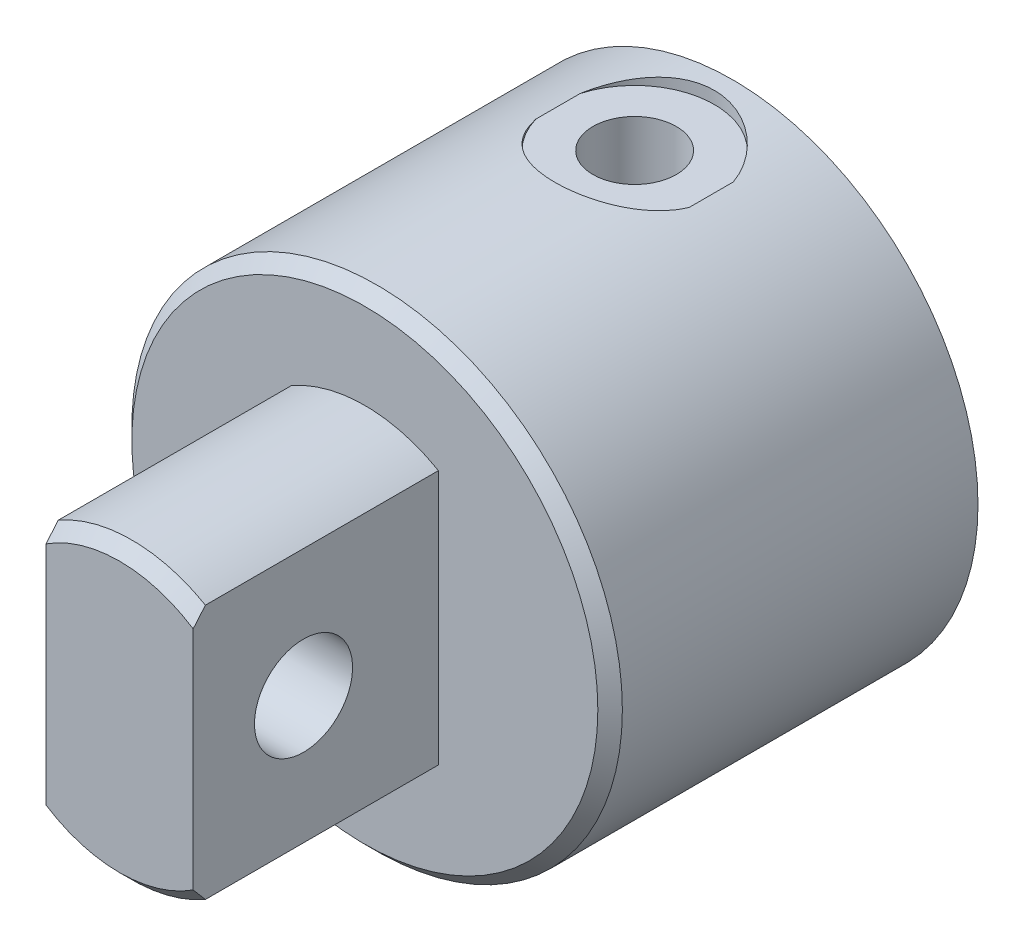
ISO-10303-21;
HEADER;
FILE_DESCRIPTION(('STEP AP214'),'2;1');
FILE_NAME('part.step','',(''),(''),'','','');
FILE_SCHEMA(('AUTOMOTIVE_DESIGN { 1 0 10303 214 1 1 1 1 }'));
ENDSEC;
DATA;
#1=APPLICATION_CONTEXT('core data for automotive mechanical design processes');
#2=APPLICATION_PROTOCOL_DEFINITION('international standard','automotive_design',2000,#1);
#3=PRODUCT_CONTEXT('',#1,'mechanical');
#4=PRODUCT('Part','Part','',(#3));
#5=PRODUCT_RELATED_PRODUCT_CATEGORY('part','',(#4));
#6=PRODUCT_DEFINITION_FORMATION('','',#4);
#7=PRODUCT_DEFINITION_CONTEXT('part definition',#1,'design');
#8=PRODUCT_DEFINITION('design','',#6,#7);
#9=PRODUCT_DEFINITION_SHAPE('','',#8);
#10=(LENGTH_UNIT() NAMED_UNIT(*) SI_UNIT(.MILLI.,.METRE.));
#11=(NAMED_UNIT(*) PLANE_ANGLE_UNIT() SI_UNIT($,.RADIAN.));
#12=(NAMED_UNIT(*) SI_UNIT($,.STERADIAN.) SOLID_ANGLE_UNIT());
#13=UNCERTAINTY_MEASURE_WITH_UNIT(LENGTH_MEASURE(1.E-05),#10,'distance_accuracy_value','');
#14=(GEOMETRIC_REPRESENTATION_CONTEXT(3) GLOBAL_UNCERTAINTY_ASSIGNED_CONTEXT((#13)) GLOBAL_UNIT_ASSIGNED_CONTEXT((#10,
#11,#12)) REPRESENTATION_CONTEXT('',''));
#15=CARTESIAN_POINT('',(0.,0.,0.));
#16=DIRECTION('',(0.,0.,1.));
#17=DIRECTION('',(1.,0.,0.));
#18=AXIS2_PLACEMENT_3D('',#15,#16,#17);
#19=CARTESIAN_POINT('',(0.,0.,50.));
#20=DIRECTION('',(0.,0.,-1.));
#21=DIRECTION('',(-1.,0.,0.));
#22=AXIS2_PLACEMENT_3D('',#19,#20,#21);
#23=CYLINDRICAL_SURFACE('',#22,12.);
#24=DIRECTION('',(0.,0.,-1.));
#25=VECTOR('',#24,1.);
#26=CARTESIAN_POINT('',(-6.00000000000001,-10.3923048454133,50.));
#27=LINE('',#26,#25);
#28=CARTESIAN_POINT('',(-6.00000000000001,-10.3923048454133,48.9999999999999));
#29=VERTEX_POINT('',#28);
#30=CARTESIAN_POINT('',(-6.00000000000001,-10.3923048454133,30.));
#31=VERTEX_POINT('',#30);
#32=EDGE_CURVE('E431',#29,#31,#27,.T.);
#33=ORIENTED_EDGE('',*,*,#32,.T.);
#34=CARTESIAN_POINT('',(0.,0.,30.));
#35=DIRECTION('',(0.,0.,1.));
#36=DIRECTION('',(1.,0.,0.));
#37=AXIS2_PLACEMENT_3D('',#34,#35,#36);
#38=CIRCLE('',#37,12.);
#39=CARTESIAN_POINT('',(6.00000000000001,-10.3923048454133,30.));
#40=VERTEX_POINT('',#39);
#41=EDGE_CURVE('E439',#31,#40,#38,.T.);
#42=ORIENTED_EDGE('',*,*,#41,.T.);
#43=DIRECTION('',(0.,0.,-1.));
#44=VECTOR('',#43,1.);
#45=CARTESIAN_POINT('',(6.00000000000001,-10.3923048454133,50.));
#46=LINE('',#45,#44);
#47=CARTESIAN_POINT('',(6.00000000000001,-10.3923048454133,48.9999999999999));
#48=VERTEX_POINT('',#47);
#49=EDGE_CURVE('E576',#48,#40,#46,.T.);
#50=ORIENTED_EDGE('',*,*,#49,.F.);
#51=CARTESIAN_POINT('',(0.,0.,48.9999999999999));
#52=DIRECTION('',(0.,0.,-1.));
#53=DIRECTION('',(-1.,0.,0.));
#54=AXIS2_PLACEMENT_3D('',#51,#52,#53);
#55=CIRCLE('',#54,12.);
#56=EDGE_CURVE('E445',#48,#29,#55,.T.);
#57=ORIENTED_EDGE('',*,*,#56,.T.);
#58=EDGE_LOOP('',(#33,#42,#50,#57));
#59=FACE_BOUND('',#58,.T.);
#60=ADVANCED_FACE('F356',(#59),#23,.T.);
#61=CARTESIAN_POINT('',(0.,0.,48.9999999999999));
#62=DIRECTION('',(0.,0.,-1.));
#63=DIRECTION('',(-1.,0.,0.));
#64=AXIS2_PLACEMENT_3D('',#61,#62,#63);
#65=CONICAL_SURFACE('',#64,12.,0.785398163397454);
#66=CARTESIAN_POINT('',(-6.00000000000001,-17.7322528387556,42.2801498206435));
#67=CARTESIAN_POINT('',(-6.00000000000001,-17.3595414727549,42.6331745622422));
#68=CARTESIAN_POINT('',(-6.00000000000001,-16.9862806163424,42.9856215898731));
#69=CARTESIAN_POINT('',(-6.00000000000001,-16.2383786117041,43.6890619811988));
#70=CARTESIAN_POINT('',(-6.00000000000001,-15.8637374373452,44.0400553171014));
#71=CARTESIAN_POINT('',(-6.00000000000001,-15.1126234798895,44.7404483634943));
#72=CARTESIAN_POINT('',(-6.00000000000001,-14.7361498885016,45.0898472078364));
#73=CARTESIAN_POINT('',(-6.00000000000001,-13.9811794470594,45.7864479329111));
#74=CARTESIAN_POINT('',(-6.00000000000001,-13.6026826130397,46.1336498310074));
#75=CARTESIAN_POINT('',(-6.00000000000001,-12.8447153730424,46.8238836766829));
#76=CARTESIAN_POINT('',(-6.00000000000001,-12.465255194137,47.1669268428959));
#77=CARTESIAN_POINT('',(-6.00000000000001,-11.7031848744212,47.8494949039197));
#78=CARTESIAN_POINT('',(-6.00000000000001,-11.320574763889,48.1890198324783));
#79=CARTESIAN_POINT('',(-6.00000000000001,-10.5513353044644,48.8634261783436));
#80=CARTESIAN_POINT('',(-6.00000000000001,-10.1647063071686,49.1983079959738));
#81=CARTESIAN_POINT('',(-6.00000000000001,-9.38615582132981,49.8618530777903));
#82=CARTESIAN_POINT('',(-6.00000000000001,-8.99423457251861,50.190516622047));
#83=CARTESIAN_POINT('',(-6.00000000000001,-8.27716455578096,50.7785680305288));
#84=CARTESIAN_POINT('',(-6.00000000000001,-7.95322295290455,51.0394251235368));
#85=CARTESIAN_POINT('',(-6.00000000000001,-7.29932278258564,51.5533558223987));
#86=CARTESIAN_POINT('',(-6.00000000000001,-6.96936589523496,51.8064315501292));
#87=CARTESIAN_POINT('',(-6.00000000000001,-6.46815126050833,52.1781811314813));
#88=CARTESIAN_POINT('',(-6.00000000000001,-6.29988564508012,52.3008891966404));
#89=CARTESIAN_POINT('',(-6.00000000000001,-5.96104178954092,52.5430523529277));
#90=CARTESIAN_POINT('',(-6.00000000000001,-5.79046370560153,52.6625076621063));
#91=CARTESIAN_POINT('',(-6.00000000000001,-5.44648573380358,52.8976312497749));
#92=CARTESIAN_POINT('',(-6.00000000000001,-5.27308350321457,53.013296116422));
#93=CARTESIAN_POINT('',(-6.00000000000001,-4.92314231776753,53.2398622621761));
#94=CARTESIAN_POINT('',(-6.00000000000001,-4.74660264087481,53.350762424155));
#95=CARTESIAN_POINT('',(-6.00000000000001,-4.56830405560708,53.4588195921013));
#96=B_SPLINE_CURVE_WITH_KNOTS('',3,(#66,#67,#68,#69,#70,#71,#72,#73,#74,#75,#76,#77,#78,#79,#80,
#81,#82,#83,#84,#85,#86,#87,#88,#89,#90,#91,#92,#93,#94,#95),.UNSPECIFIED.,.F.,.F.,(4,2,2,2,2,2,
2,2,2,2,2,2,2,2,4),(0.,1.54008695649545,3.08020322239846,4.62107493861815,6.16193446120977,
7.69652463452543,9.23110007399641,10.7655423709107,12.2999153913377,13.5475814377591,
14.7949041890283,15.4196417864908,16.0443374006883,16.6695806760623,17.294969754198),.UNSPECIFIED.);
#97=CARTESIAN_POINT('',(-6.00000000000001,-9.21954445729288,50.));
#98=VERTEX_POINT('',#97);
#99=EDGE_CURVE('E488',#29,#98,#96,.T.);
#100=ORIENTED_EDGE('',*,*,#99,.F.);
#101=ORIENTED_EDGE('',*,*,#56,.F.);
#102=CARTESIAN_POINT('',(6.00000000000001,-4.56830405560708,53.4588195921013));
#103=CARTESIAN_POINT('',(6.00000000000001,-4.74660264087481,53.350762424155));
#104=CARTESIAN_POINT('',(6.00000000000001,-4.92314231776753,53.2398622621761));
#105=CARTESIAN_POINT('',(6.00000000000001,-5.27308350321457,53.013296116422));
#106=CARTESIAN_POINT('',(6.00000000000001,-5.44648573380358,52.8976312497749));
#107=CARTESIAN_POINT('',(6.00000000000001,-5.79046370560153,52.6625076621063));
#108=CARTESIAN_POINT('',(6.00000000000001,-5.96104178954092,52.5430523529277));
#109=CARTESIAN_POINT('',(6.00000000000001,-6.29988564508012,52.3008891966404));
#110=CARTESIAN_POINT('',(6.00000000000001,-6.46815126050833,52.1781811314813));
#111=CARTESIAN_POINT('',(6.00000000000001,-6.96936589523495,51.8064315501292));
#112=CARTESIAN_POINT('',(6.00000000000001,-7.29932278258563,51.5533558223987));
#113=CARTESIAN_POINT('',(6.00000000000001,-7.95322295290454,51.0394251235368));
#114=CARTESIAN_POINT('',(6.00000000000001,-8.27716455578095,50.7785680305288));
#115=CARTESIAN_POINT('',(6.00000000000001,-8.9942345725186,50.190516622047));
#116=CARTESIAN_POINT('',(6.00000000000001,-9.3861558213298,49.8618530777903));
#117=CARTESIAN_POINT('',(6.00000000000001,-10.1647063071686,49.1983079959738));
#118=CARTESIAN_POINT('',(6.00000000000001,-10.5513353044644,48.8634261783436));
#119=CARTESIAN_POINT('',(6.00000000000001,-11.320574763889,48.1890198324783));
#120=CARTESIAN_POINT('',(6.00000000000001,-11.7031848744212,47.8494949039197));
#121=CARTESIAN_POINT('',(6.00000000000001,-12.465255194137,47.1669268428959));
#122=CARTESIAN_POINT('',(6.00000000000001,-12.8447153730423,46.8238836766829));
#123=CARTESIAN_POINT('',(6.00000000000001,-13.6026826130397,46.1336498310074));
#124=CARTESIAN_POINT('',(6.00000000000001,-13.9811794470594,45.7864479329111));
#125=CARTESIAN_POINT('',(6.00000000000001,-14.7361498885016,45.0898472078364));
#126=CARTESIAN_POINT('',(6.00000000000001,-15.1126234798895,44.7404483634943));
#127=CARTESIAN_POINT('',(6.00000000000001,-15.8637374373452,44.0400553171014));
#128=CARTESIAN_POINT('',(6.00000000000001,-16.2383786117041,43.6890619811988));
#129=CARTESIAN_POINT('',(6.00000000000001,-16.9862806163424,42.9856215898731));
#130=CARTESIAN_POINT('',(6.00000000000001,-17.3595414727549,42.6331745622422));
#131=CARTESIAN_POINT('',(6.00000000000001,-17.7322528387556,42.2801498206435));
#132=B_SPLINE_CURVE_WITH_KNOTS('',3,(#102,#103,#104,#105,#106,#107,#108,#109,#110,#111,#112,
#113,#114,#115,#116,#117,#118,#119,#120,#121,#122,#123,#124,#125,#126,#127,#128,#129,#130,#131),
.UNSPECIFIED.,.F.,.F.,(4,2,2,2,2,2,2,2,2,2,2,2,2,2,4),(0.,0.625389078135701,1.2506323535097,
1.87532796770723,2.50006556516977,3.74738831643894,4.99505436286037,6.52942738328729,
8.06386968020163,9.59844511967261,11.1330352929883,12.6738948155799,14.2147665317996,
15.7548827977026,17.294969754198),.UNSPECIFIED.);
#133=CARTESIAN_POINT('',(6.00000000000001,-9.21954445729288,50.));
#134=VERTEX_POINT('',#133);
#135=EDGE_CURVE('E463',#134,#48,#132,.T.);
#136=ORIENTED_EDGE('',*,*,#135,.F.);
#137=CARTESIAN_POINT('',(0.,0.,50.));
#138=DIRECTION('',(0.,0.,-1.));
#139=DIRECTION('',(-1.,0.,0.));
#140=AXIS2_PLACEMENT_3D('',#137,#138,#139);
#141=CIRCLE('',#140,11.);
#142=EDGE_CURVE('E452',#98,#134,#141,.F.);
#143=ORIENTED_EDGE('',*,*,#142,.F.);
#144=EDGE_LOOP('',(#100,#101,#136,#143));
#145=FACE_BOUND('',#144,.T.);
#146=ADVANCED_FACE('F505',(#145),#65,.T.);
#147=CARTESIAN_POINT('',(0.,0.,30.));
#148=DIRECTION('',(0.,0.,-1.));
#149=DIRECTION('',(-1.,0.,0.));
#150=AXIS2_PLACEMENT_3D('',#147,#148,#149);
#151=CYLINDRICAL_SURFACE('',#150,20.);
#152=CARTESIAN_POINT('',(0.,0.,28.9999999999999));
#153=DIRECTION('',(0.,0.,1.));
#154=DIRECTION('',(1.,0.,0.));
#155=AXIS2_PLACEMENT_3D('',#152,#153,#154);
#156=CIRCLE('',#155,20.);
#157=CARTESIAN_POINT('',(20.,0.,28.9999999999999));
#158=VERTEX_POINT('',#157);
#159=EDGE_CURVE('E13',#158,#158,#156,.F.);
#160=ORIENTED_EDGE('',*,*,#159,.T.);
#161=EDGE_LOOP('',(#160));
#162=FACE_BOUND('',#161,.T.);
#163=CARTESIAN_POINT('',(0.,0.,0.));
#164=DIRECTION('',(0.,0.,1.));
#165=DIRECTION('',(1.,0.,0.));
#166=AXIS2_PLACEMENT_3D('',#163,#164,#165);
#167=CIRCLE('',#166,20.);
#168=CARTESIAN_POINT('',(20.,0.,0.));
#169=VERTEX_POINT('',#168);
#170=EDGE_CURVE('E562',#169,#169,#167,.T.);
#171=ORIENTED_EDGE('',*,*,#170,.T.);
#172=EDGE_LOOP('',(#171));
#173=FACE_BOUND('',#172,.T.);
#174=DIRECTION('',(0.,0.,-1.));
#175=VECTOR('',#174,1.);
#176=CARTESIAN_POINT('',(6.24499799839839,19.,30.));
#177=LINE('',#176,#175);
#178=CARTESIAN_POINT('',(6.24499799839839,19.,9.80277563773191));
#179=VERTEX_POINT('',#178);
#180=CARTESIAN_POINT('',(6.24499799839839,19.,6.19722436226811));
#181=VERTEX_POINT('',#180);
#182=EDGE_CURVE('E447',#179,#181,#177,.T.);
#183=ORIENTED_EDGE('',*,*,#182,.F.);
#184=CARTESIAN_POINT('',(-6.24499799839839,19.,9.80277563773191));
#185=CARTESIAN_POINT('',(-6.19409175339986,19.0167193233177,9.97918899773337));
#186=CARTESIAN_POINT('',(-6.13573893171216,19.0356851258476,10.1532131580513));
#187=CARTESIAN_POINT('',(-6.00475499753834,19.0774150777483,10.4952712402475));
#188=CARTESIAN_POINT('',(-5.93212844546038,19.1001780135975,10.6633070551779));
#189=CARTESIAN_POINT('',(-5.77330213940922,19.1487813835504,10.9920350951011));
#190=CARTESIAN_POINT('',(-5.68712364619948,19.1746169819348,11.1527383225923));
#191=CARTESIAN_POINT('',(-5.50177391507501,19.2286194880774,11.4660660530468));
#192=CARTESIAN_POINT('',(-5.40260182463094,19.2567865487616,11.6186900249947));
#193=CARTESIAN_POINT('',(-5.19206969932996,19.3146139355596,11.9147643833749));
#194=CARTESIAN_POINT('',(-5.08072097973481,19.3442728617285,12.0582230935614));
#195=CARTESIAN_POINT('',(-4.84645582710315,19.4042904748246,12.3352958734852));
#196=CARTESIAN_POINT('',(-4.7235351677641,19.4346494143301,12.4689063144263));
#197=CARTESIAN_POINT('',(-4.46694304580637,19.4952248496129,12.7253913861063));
#198=CARTESIAN_POINT('',(-4.33327219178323,19.5254413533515,12.8482666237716));
#199=CARTESIAN_POINT('',(-4.05594823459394,19.5849278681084,13.082543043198));
#200=CARTESIAN_POINT('',(-3.91229168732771,19.6141975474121,13.193940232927));
#201=CARTESIAN_POINT('',(-3.61297921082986,19.671554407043,13.4065461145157));
#202=CARTESIAN_POINT('',(-3.45714189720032,19.6996066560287,13.5075091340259));
#203=CARTESIAN_POINT('',(-3.13706684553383,19.7531044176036,13.695901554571));
#204=CARTESIAN_POINT('',(-2.97282934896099,19.7785500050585,13.7833313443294));
#205=CARTESIAN_POINT('',(-2.63705466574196,19.8261113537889,13.9439531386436));
#206=CARTESIAN_POINT('',(-2.46551711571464,19.8482269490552,14.0171444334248));
#207=CARTESIAN_POINT('',(-2.11644237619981,19.8884770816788,14.1486127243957));
#208=CARTESIAN_POINT('',(-1.9389077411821,19.9066132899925,14.2068959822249));
#209=CARTESIAN_POINT('',(-1.58429351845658,19.9379230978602,14.3065800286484));
#210=CARTESIAN_POINT('',(-1.40734844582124,19.9512247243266,14.3484191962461));
#211=CARTESIAN_POINT('',(-1.05036510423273,19.9731994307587,14.4171455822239));
#212=CARTESIAN_POINT('',(-0.870328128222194,19.9818743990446,14.4440389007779));
#213=CARTESIAN_POINT('',(-0.508475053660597,19.9943548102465,14.4826351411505));
#214=CARTESIAN_POINT('',(-0.326659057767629,19.9981605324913,14.4943389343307));
#215=CARTESIAN_POINT('',(0.0373476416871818,20.0007931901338,14.5024413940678));
#216=CARTESIAN_POINT('',(0.219538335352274,19.9996202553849,14.4988404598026));
#217=CARTESIAN_POINT('',(0.575566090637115,19.9924772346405,14.4768237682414));
#218=CARTESIAN_POINT('',(0.749444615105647,19.986701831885,14.4590092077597));
#219=CARTESIAN_POINT('',(1.09506419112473,19.9707478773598,14.4094711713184));
#220=CARTESIAN_POINT('',(1.26680449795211,19.960567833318,14.3777429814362));
#221=CARTESIAN_POINT('',(1.60683520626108,19.9360760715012,14.3006715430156));
#222=CARTESIAN_POINT('',(1.7751267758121,19.9217657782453,14.2553329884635));
#223=CARTESIAN_POINT('',(2.10725966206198,19.8893768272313,14.1514020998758));
#224=CARTESIAN_POINT('',(2.2710992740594,19.8712967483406,14.0928047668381));
#225=CARTESIAN_POINT('',(2.59441141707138,19.8316855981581,13.9623521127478));
#226=CARTESIAN_POINT('',(2.75384246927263,19.8101298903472,13.8904015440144));
#227=CARTESIAN_POINT('',(3.06612613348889,19.7642047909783,13.7340539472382));
#228=CARTESIAN_POINT('',(3.21897632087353,19.7398343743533,13.6496523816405));
#229=CARTESIAN_POINT('',(3.51712665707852,19.688897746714,13.4690218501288));
#230=CARTESIAN_POINT('',(3.66242699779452,19.6623315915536,13.3727931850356));
#231=CARTESIAN_POINT('',(3.94469941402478,19.6076522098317,13.1691054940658));
#232=CARTESIAN_POINT('',(4.08166838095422,19.5795384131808,13.061642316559));
#233=CARTESIAN_POINT('',(4.35233701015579,19.5211980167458,12.8311637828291));
#234=CARTESIAN_POINT('',(4.48562099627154,19.4909330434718,12.7076695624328));
#235=CARTESIAN_POINT('',(4.74142831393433,19.4302894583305,12.4499262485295));
#236=CARTESIAN_POINT('',(4.86394717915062,19.3999108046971,12.3156727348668));
#237=CARTESIAN_POINT('',(5.09728484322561,19.3399118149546,12.0374019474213));
#238=CARTESIAN_POINT('',(5.20811440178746,19.3102908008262,11.8933938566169));
#239=CARTESIAN_POINT('',(5.41746994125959,19.2526053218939,11.5963963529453));
#240=CARTESIAN_POINT('',(5.51599334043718,19.2245411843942,11.4434050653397));
#241=CARTESIAN_POINT('',(5.74398657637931,19.1579414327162,11.0543117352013));
#242=CARTESIAN_POINT('',(5.86579519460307,19.1207978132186,10.8133815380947));
#243=CARTESIAN_POINT('',(6.02550700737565,19.0708250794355,10.441618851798));
#244=CARTESIAN_POINT('',(6.07491048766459,19.0551247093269,10.3159709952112));
#245=CARTESIAN_POINT('',(6.16588265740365,19.0258808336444,10.061583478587));
#246=CARTESIAN_POINT('',(6.2074490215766,19.0123379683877,9.93284291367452));
#247=CARTESIAN_POINT('',(6.24499799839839,19.,9.80277563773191));
#248=B_SPLINE_CURVE_WITH_KNOTS('',3,(#184,#185,#186,#187,#188,#189,#190,#191,#192,#193,#194,
#195,#196,#197,#198,#199,#200,#201,#202,#203,#204,#205,#206,#207,#208,#209,#210,#211,#212,#213,
#214,#215,#216,#217,#218,#219,#220,#221,#222,#223,#224,#225,#226,#227,#228,#229,#230,#231,#232,
#233,#234,#235,#236,#237,#238,#239,#240,#241,#242,#243,#244,#245,#246,#247),.UNSPECIFIED.,.F.,
.F.,(4,2,2,2,2,2,2,2,2,2,2,2,2,2,2,2,2,2,2,2,2,2,2,2,2,2,2,2,2,2,2,4),(0.,0.552897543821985,
1.10561872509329,1.6574812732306,2.20938004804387,2.7607702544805,3.31236262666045,
3.86392379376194,4.41567614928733,4.97836332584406,5.54103433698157,6.10373338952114,
6.66619570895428,7.21243805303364,7.75845728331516,8.30444518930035,8.85041885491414,
9.37445082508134,9.89866047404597,10.4226895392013,10.9469165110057,11.4750374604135,
12.0033513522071,12.5316518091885,13.0601481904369,13.6121270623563,14.164333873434,
14.7160278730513,15.2678374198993,16.0829103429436,16.490440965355,16.89809231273),.UNSPECIFIED.);
#249=CARTESIAN_POINT('',(-6.24499799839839,19.,9.80277563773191));
#250=VERTEX_POINT('',#249);
#251=EDGE_CURVE('E544',#250,#179,#248,.T.);
#252=ORIENTED_EDGE('',*,*,#251,.F.);
#253=DIRECTION('',(0.,0.,-1.));
#254=VECTOR('',#253,1.);
#255=CARTESIAN_POINT('',(-6.24499799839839,19.,30.));
#256=LINE('',#255,#254);
#257=CARTESIAN_POINT('',(-6.24499799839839,19.,6.19722436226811));
#258=VERTEX_POINT('',#257);
#259=EDGE_CURVE('E558',#258,#250,#256,.F.);
#260=ORIENTED_EDGE('',*,*,#259,.F.);
#261=CARTESIAN_POINT('',(6.24499799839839,19.,6.19722436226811));
#262=CARTESIAN_POINT('',(6.1940900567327,19.0167198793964,6.02080511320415));
#263=CARTESIAN_POINT('',(6.13573503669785,19.0356863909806,5.84677522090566));
#264=CARTESIAN_POINT('',(6.00474574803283,19.0774179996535,5.50470605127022));
#265=CARTESIAN_POINT('',(5.93211603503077,19.100181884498,5.33666488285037));
#266=CARTESIAN_POINT('',(5.77328785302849,19.1487856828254,5.00793770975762));
#267=CARTESIAN_POINT('',(5.68711156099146,19.1746205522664,4.84724022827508));
#268=CARTESIAN_POINT('',(5.50176718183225,19.2286214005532,4.53392358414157));
#269=CARTESIAN_POINT('',(5.40259825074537,19.2567875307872,4.38130494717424));
#270=CARTESIAN_POINT('',(5.19207631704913,19.314612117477,4.08524492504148));
#271=CARTESIAN_POINT('',(5.08073498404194,19.3442691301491,3.94179495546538));
#272=CARTESIAN_POINT('',(4.8464886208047,19.4042822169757,3.66474142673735));
#273=CARTESIAN_POINT('',(4.72357961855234,19.4346385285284,3.53114127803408));
#274=CARTESIAN_POINT('',(4.46696940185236,19.4952190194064,3.27463179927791));
#275=CARTESIAN_POINT('',(4.33326518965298,19.5254431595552,3.1517254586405));
#276=CARTESIAN_POINT('',(4.05591880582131,19.5849338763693,2.9174340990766));
#277=CARTESIAN_POINT('',(3.91227669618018,19.614200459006,2.80604900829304));
#278=CARTESIAN_POINT('',(3.61290423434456,19.6715687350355,2.59340074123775));
#279=CARTESIAN_POINT('',(3.45698688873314,19.6996344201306,2.49239080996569));
#280=CARTESIAN_POINT('',(3.13680015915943,19.7531471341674,2.30395030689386));
#281=CARTESIAN_POINT('',(2.97253383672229,19.7785951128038,2.21651480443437));
#282=CARTESIAN_POINT('',(2.63679293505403,19.8261451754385,2.05593416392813));
#283=CARTESIAN_POINT('',(2.46532242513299,19.8482491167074,1.98278108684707));
#284=CARTESIAN_POINT('',(2.11637900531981,19.8884846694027,1.85136456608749));
#285=CARTESIAN_POINT('',(1.93890717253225,19.9066169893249,1.79309846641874));
#286=CARTESIAN_POINT('',(1.47396044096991,19.9476589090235,1.6624132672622));
#287=CARTESIAN_POINT('',(1.18281698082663,19.9671666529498,1.60162596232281));
#288=CARTESIAN_POINT('',(0.594393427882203,19.9933328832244,1.52042687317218));
#289=CARTESIAN_POINT('',(0.297114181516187,19.9999931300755,1.50000955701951));
#290=CARTESIAN_POINT('',(-0.177565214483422,20.000004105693,1.49999428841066));
#291=CARTESIAN_POINT('',(-0.355071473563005,19.9976318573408,1.50727751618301));
#292=CARTESIAN_POINT('',(-0.708820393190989,19.9882173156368,1.53632892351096));
#293=CARTESIAN_POINT('',(-0.885062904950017,19.9811744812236,1.55809878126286));
#294=CARTESIAN_POINT('',(-1.23499698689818,19.9626028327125,1.61593747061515));
#295=CARTESIAN_POINT('',(-1.40868765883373,19.9510724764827,1.65201121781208));
#296=CARTESIAN_POINT('',(-1.75229852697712,19.9238339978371,1.73814475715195));
#297=CARTESIAN_POINT('',(-1.9222172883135,19.9081243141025,1.78820977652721));
#298=CARTESIAN_POINT('',(-2.25668014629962,19.8729869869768,1.90176112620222));
#299=CARTESIAN_POINT('',(-2.42123540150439,19.8535677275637,1.96521722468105));
#300=CARTESIAN_POINT('',(-2.74435799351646,19.8114879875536,2.10512876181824));
#301=CARTESIAN_POINT('',(-2.90292321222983,19.7888263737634,2.18158874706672));
#302=CARTESIAN_POINT('',(-3.21300945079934,19.7408506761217,2.3469088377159));
#303=CARTESIAN_POINT('',(-3.36453108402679,19.7155368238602,2.4357678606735));
#304=CARTESIAN_POINT('',(-3.65964980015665,19.6628948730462,2.6252704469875));
#305=CARTESIAN_POINT('',(-3.80324658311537,19.635566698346,2.72591445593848));
#306=CARTESIAN_POINT('',(-4.08590148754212,19.5787337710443,2.9415461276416));
#307=CARTESIAN_POINT('',(-4.22469055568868,19.5491881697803,3.0568758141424));
#308=CARTESIAN_POINT('',(-4.49209054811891,19.489481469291,3.29855435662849));
#309=CARTESIAN_POINT('',(-4.62070463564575,19.4593205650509,3.42489976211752));
#310=CARTESIAN_POINT('',(-4.86703051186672,19.399177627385,3.6878688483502));
#311=CARTESIAN_POINT('',(-4.98474120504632,19.3691956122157,3.82449355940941));
#312=CARTESIAN_POINT('',(-5.20845794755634,19.310239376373,4.10713045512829));
#313=CARTESIAN_POINT('',(-5.31446871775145,19.2812647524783,4.25313881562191));
#314=CARTESIAN_POINT('',(-5.50543153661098,19.2275633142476,4.54061356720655));
#315=CARTESIAN_POINT('',(-5.5914134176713,19.202686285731,4.68136901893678));
#316=CARTESIAN_POINT('',(-5.75255453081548,19.1550299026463,4.96926950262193));
#317=CARTESIAN_POINT('',(-5.82771504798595,19.1322502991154,5.11641377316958));
#318=CARTESIAN_POINT('',(-5.96678522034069,19.0893373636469,5.41643309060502));
#319=CARTESIAN_POINT('',(-6.03068685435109,19.0692059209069,5.56931212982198));
#320=CARTESIAN_POINT('',(-6.14675890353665,19.0321039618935,5.87988411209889));
#321=CARTESIAN_POINT('',(-6.19892573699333,19.0151344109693,6.03757850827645));
#322=CARTESIAN_POINT('',(-6.24499799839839,19.,6.19722436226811));
#323=B_SPLINE_CURVE_WITH_KNOTS('',3,(#261,#262,#263,#264,#265,#266,#267,#268,#269,#270,#271,
#272,#273,#274,#275,#276,#277,#278,#279,#280,#281,#282,#283,#284,#285,#286,#287,#288,#289,#290,
#291,#292,#293,#294,#295,#296,#297,#298,#299,#300,#301,#302,#303,#304,#305,#306,#307,#308,#309,
#310,#311,#312,#313,#314,#315,#316,#317,#318,#319,#320,#321,#322),.UNSPECIFIED.,.F.,.F.,(4,2,2,
2,2,2,2,2,2,2,2,2,2,2,2,2,2,2,2,2,2,2,2,2,2,2,2,2,2,2,4),(0.,0.552915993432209,1.10565581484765,
1.65749999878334,2.20938004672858,2.76073557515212,3.31228111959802,3.86398035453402,
4.41567614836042,4.97864172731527,5.54140233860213,6.10384923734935,6.6661957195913,
7.55721473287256,8.44811164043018,8.98054095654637,9.51303196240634,10.0457061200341,
10.5785795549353,11.1102625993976,11.6421319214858,12.1739548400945,12.7057978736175,
13.2537435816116,13.8015182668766,14.3493479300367,14.896955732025,15.3968966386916,
15.8967781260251,16.397014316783,16.8974029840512),.UNSPECIFIED.);
#324=EDGE_CURVE('E549',#181,#258,#323,.T.);
#325=ORIENTED_EDGE('',*,*,#324,.F.);
#326=EDGE_LOOP('',(#183,#252,#260,#325));
#327=FACE_BOUND('',#326,.T.);
#328=ADVANCED_FACE('F358',(#162,#173,#327),#151,.T.);
#329=CARTESIAN_POINT('',(0.,0.,30.));
#330=DIRECTION('',(0.,0.,1.));
#331=DIRECTION('',(1.,0.,0.));
#332=AXIS2_PLACEMENT_3D('',#329,#330,#331);
#333=PLANE('',#332);
#334=CARTESIAN_POINT('',(0.,0.,30.));
#335=DIRECTION('',(0.,0.,1.));
#336=DIRECTION('',(1.,0.,0.));
#337=AXIS2_PLACEMENT_3D('',#334,#335,#336);
#338=CIRCLE('',#337,19.);
#339=CARTESIAN_POINT('',(19.,0.,30.));
#340=VERTEX_POINT('',#339);
#341=EDGE_CURVE('E365',#340,#340,#338,.T.);
#342=ORIENTED_EDGE('',*,*,#341,.T.);
#343=EDGE_LOOP('',(#342));
#344=FACE_BOUND('',#343,.T.);
#345=CARTESIAN_POINT('',(6.00000000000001,10.3923048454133,30.));
#346=VERTEX_POINT('',#345);
#347=CARTESIAN_POINT('',(-6.00000000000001,10.3923048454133,30.));
#348=VERTEX_POINT('',#347);
#349=EDGE_CURVE('E438',#346,#348,#38,.T.);
#350=ORIENTED_EDGE('',*,*,#349,.F.);
#351=DIRECTION('',(0.,1.,0.));
#352=VECTOR('',#351,1.);
#353=CARTESIAN_POINT('',(6.00000000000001,-10.3923048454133,30.));
#354=LINE('',#353,#352);
#355=EDGE_CURVE('E583',#40,#346,#354,.T.);
#356=ORIENTED_EDGE('',*,*,#355,.F.);
#357=ORIENTED_EDGE('',*,*,#41,.F.);
#358=DIRECTION('',(0.,-1.,0.));
#359=VECTOR('',#358,1.);
#360=CARTESIAN_POINT('',(-6.00000000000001,-10.3923048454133,30.));
#361=LINE('',#360,#359);
#362=EDGE_CURVE('E427',#348,#31,#361,.T.);
#363=ORIENTED_EDGE('',*,*,#362,.F.);
#364=EDGE_LOOP('',(#350,#356,#357,#363));
#365=FACE_BOUND('',#364,.T.);
#366=ADVANCED_FACE('F436',(#344,#365),#333,.T.);
#367=CARTESIAN_POINT('',(0.,0.,0.));
#368=DIRECTION('',(0.,0.,1.));
#369=DIRECTION('',(1.,0.,0.));
#370=AXIS2_PLACEMENT_3D('',#367,#368,#369);
#371=PLANE('',#370);
#372=ORIENTED_EDGE('',*,*,#170,.F.);
#373=EDGE_LOOP('',(#372));
#374=FACE_BOUND('',#373,.T.);
#375=ADVANCED_FACE('F540',(#374),#371,.F.);
#376=CARTESIAN_POINT('',(0.,20.,8.00000000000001));
#377=DIRECTION('',(0.,-1.,0.));
#378=DIRECTION('',(0.,0.,-1.));
#379=AXIS2_PLACEMENT_3D('',#376,#377,#378);
#380=CYLINDRICAL_SURFACE('',#379,6.5);
#381=ORIENTED_EDGE('',*,*,#251,.T.);
#382=CARTESIAN_POINT('',(0.,19.,8.00000000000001));
#383=DIRECTION('',(0.,1.,0.));
#384=DIRECTION('',(0.,0.,1.));
#385=AXIS2_PLACEMENT_3D('',#382,#383,#384);
#386=CIRCLE('',#385,6.5);
#387=EDGE_CURVE('E568',#250,#179,#386,.T.);
#388=ORIENTED_EDGE('',*,*,#387,.F.);
#389=EDGE_LOOP('',(#381,#388));
#390=FACE_BOUND('',#389,.T.);
#391=ADVANCED_FACE('F537',(#390),#380,.F.);
#392=ORIENTED_EDGE('',*,*,#324,.T.);
#393=EDGE_CURVE('E565',#181,#258,#386,.T.);
#394=ORIENTED_EDGE('',*,*,#393,.F.);
#395=EDGE_LOOP('',(#392,#394));
#396=FACE_BOUND('',#395,.T.);
#397=ADVANCED_FACE('F535',(#396),#380,.F.);
#398=CARTESIAN_POINT('',(0.,19.,8.00000000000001));
#399=DIRECTION('',(0.,1.,0.));
#400=DIRECTION('',(0.,0.,1.));
#401=AXIS2_PLACEMENT_3D('',#398,#399,#400);
#402=PLANE('',#401);
#403=CARTESIAN_POINT('',(0.,19.,8.00000000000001));
#404=DIRECTION('',(0.,1.,0.));
#405=DIRECTION('',(0.,0.,1.));
#406=AXIS2_PLACEMENT_3D('',#403,#404,#405);
#407=CIRCLE('',#406,3.39999999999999);
#408=CARTESIAN_POINT('',(0.,19.,11.4));
#409=VERTEX_POINT('',#408);
#410=EDGE_CURVE('E570',#409,#409,#407,.T.);
#411=ORIENTED_EDGE('',*,*,#410,.F.);
#412=EDGE_LOOP('',(#411));
#413=FACE_BOUND('',#412,.T.);
#414=ORIENTED_EDGE('',*,*,#182,.T.);
#415=ORIENTED_EDGE('',*,*,#393,.T.);
#416=ORIENTED_EDGE('',*,*,#259,.T.);
#417=ORIENTED_EDGE('',*,*,#387,.T.);
#418=EDGE_LOOP('',(#414,#415,#416,#417));
#419=FACE_BOUND('',#418,.T.);
#420=ADVANCED_FACE('F528',(#413,#419),#402,.T.);
#421=CARTESIAN_POINT('',(0.,19.,8.00000000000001));
#422=DIRECTION('',(0.,1.,0.));
#423=DIRECTION('',(0.,0.,1.));
#424=AXIS2_PLACEMENT_3D('',#421,#422,#423);
#425=CYLINDRICAL_SURFACE('',#424,3.39999999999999);
#426=CARTESIAN_POINT('',(0.,-3.24999999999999,8.00000000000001));
#427=DIRECTION('',(0.,1.,0.));
#428=DIRECTION('',(0.,0.,1.));
#429=AXIS2_PLACEMENT_3D('',#426,#427,#428);
#430=CIRCLE('',#429,3.39999999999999);
#431=CARTESIAN_POINT('',(0.,-3.24999999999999,11.4));
#432=VERTEX_POINT('',#431);
#433=EDGE_CURVE('E573',#432,#432,#430,.T.);
#434=ORIENTED_EDGE('',*,*,#433,.F.);
#435=EDGE_LOOP('',(#434));
#436=FACE_BOUND('',#435,.T.);
#437=ORIENTED_EDGE('',*,*,#410,.T.);
#438=EDGE_LOOP('',(#437));
#439=FACE_BOUND('',#438,.T.);
#440=ADVANCED_FACE('F523',(#436,#439),#425,.F.);
#441=CARTESIAN_POINT('',(0.,-3.24999999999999,8.00000000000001));
#442=DIRECTION('',(0.,1.,0.));
#443=DIRECTION('',(0.,0.,1.));
#444=AXIS2_PLACEMENT_3D('',#441,#442,#443);
#445=CONICAL_SURFACE('',#444,3.39999999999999,1.02974425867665);
#446=CARTESIAN_POINT('',(0.,-5.29292610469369,8.00000000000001));
#447=VERTEX_POINT('',#446);
#448=VERTEX_LOOP('',#447);
#449=FACE_BOUND('',#448,.T.);
#450=ORIENTED_EDGE('',*,*,#433,.T.);
#451=EDGE_LOOP('',(#450));
#452=FACE_BOUND('',#451,.T.);
#453=ADVANCED_FACE('F516',(#449,#452),#445,.F.);
#454=DIRECTION('',(0.,0.,-1.));
#455=VECTOR('',#454,1.);
#456=CARTESIAN_POINT('',(-6.00000000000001,10.3923048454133,50.));
#457=LINE('',#456,#455);
#458=CARTESIAN_POINT('',(-6.00000000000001,10.3923048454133,48.9999999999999));
#459=VERTEX_POINT('',#458);
#460=EDGE_CURVE('E424',#459,#348,#457,.T.);
#461=ORIENTED_EDGE('',*,*,#460,.F.);
#462=CARTESIAN_POINT('',(6.00000000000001,10.3923048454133,48.9999999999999));
#463=VERTEX_POINT('',#462);
#464=EDGE_CURVE('E380',#459,#463,#55,.T.);
#465=ORIENTED_EDGE('',*,*,#464,.T.);
#466=DIRECTION('',(0.,0.,-1.));
#467=VECTOR('',#466,1.);
#468=CARTESIAN_POINT('',(6.00000000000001,10.3923048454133,50.));
#469=LINE('',#468,#467);
#470=EDGE_CURVE('E443',#463,#346,#469,.T.);
#471=ORIENTED_EDGE('',*,*,#470,.T.);
#472=ORIENTED_EDGE('',*,*,#349,.T.);
#473=EDGE_LOOP('',(#461,#465,#471,#472));
#474=FACE_BOUND('',#473,.T.);
#475=ADVANCED_FACE('F442',(#474),#23,.T.);
#476=CARTESIAN_POINT('',(0.,0.,50.));
#477=DIRECTION('',(0.,0.,-1.));
#478=DIRECTION('',(-1.,0.,0.));
#479=AXIS2_PLACEMENT_3D('',#476,#477,#478);
#480=PLANE('',#479);
#481=CARTESIAN_POINT('',(6.00000000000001,9.21954445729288,50.));
#482=VERTEX_POINT('',#481);
#483=CARTESIAN_POINT('',(-6.00000000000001,9.21954445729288,50.));
#484=VERTEX_POINT('',#483);
#485=EDGE_CURVE('E453',#482,#484,#141,.F.);
#486=ORIENTED_EDGE('',*,*,#485,.T.);
#487=DIRECTION('',(0.,-1.,0.));
#488=VECTOR('',#487,1.);
#489=CARTESIAN_POINT('',(-6.00000000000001,-10.3923048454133,50.));
#490=LINE('',#489,#488);
#491=EDGE_CURVE('E372',#484,#98,#490,.T.);
#492=ORIENTED_EDGE('',*,*,#491,.T.);
#493=ORIENTED_EDGE('',*,*,#142,.T.);
#494=DIRECTION('',(0.,1.,0.));
#495=VECTOR('',#494,1.);
#496=CARTESIAN_POINT('',(6.00000000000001,-10.3923048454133,50.));
#497=LINE('',#496,#495);
#498=EDGE_CURVE('E579',#134,#482,#497,.T.);
#499=ORIENTED_EDGE('',*,*,#498,.T.);
#500=EDGE_LOOP('',(#486,#492,#493,#499));
#501=FACE_BOUND('',#500,.T.);
#502=ADVANCED_FACE('F515',(#501),#480,.F.);
#503=CARTESIAN_POINT('',(-6.00000000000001,4.56830405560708,53.4588195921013));
#504=CARTESIAN_POINT('',(-6.00000000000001,4.74660264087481,53.350762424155));
#505=CARTESIAN_POINT('',(-6.00000000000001,4.92314231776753,53.2398622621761));
#506=CARTESIAN_POINT('',(-6.00000000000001,5.27308350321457,53.013296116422));
#507=CARTESIAN_POINT('',(-6.00000000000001,5.44648573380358,52.8976312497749));
#508=CARTESIAN_POINT('',(-6.00000000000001,5.79046370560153,52.6625076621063));
#509=CARTESIAN_POINT('',(-6.00000000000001,5.96104178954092,52.5430523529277));
#510=CARTESIAN_POINT('',(-6.00000000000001,6.29988564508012,52.3008891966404));
#511=CARTESIAN_POINT('',(-6.00000000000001,6.46815126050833,52.1781811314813));
#512=CARTESIAN_POINT('',(-6.00000000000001,6.96936589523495,51.8064315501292));
#513=CARTESIAN_POINT('',(-6.00000000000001,7.29932278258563,51.5533558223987));
#514=CARTESIAN_POINT('',(-6.00000000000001,7.95322295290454,51.0394251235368));
#515=CARTESIAN_POINT('',(-6.00000000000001,8.27716455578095,50.7785680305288));
#516=CARTESIAN_POINT('',(-6.00000000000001,8.9942345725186,50.190516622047));
#517=CARTESIAN_POINT('',(-6.00000000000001,9.3861558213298,49.8618530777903));
#518=CARTESIAN_POINT('',(-6.00000000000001,10.1647063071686,49.1983079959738));
#519=CARTESIAN_POINT('',(-6.00000000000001,10.5513353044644,48.8634261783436));
#520=CARTESIAN_POINT('',(-6.00000000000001,11.320574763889,48.1890198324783));
#521=CARTESIAN_POINT('',(-6.00000000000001,11.7031848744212,47.8494949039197));
#522=CARTESIAN_POINT('',(-6.00000000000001,12.465255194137,47.1669268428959));
#523=CARTESIAN_POINT('',(-6.00000000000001,12.8447153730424,46.8238836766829));
#524=CARTESIAN_POINT('',(-6.00000000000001,13.6026826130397,46.1336498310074));
#525=CARTESIAN_POINT('',(-6.00000000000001,13.9811794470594,45.7864479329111));
#526=CARTESIAN_POINT('',(-6.00000000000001,14.7361498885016,45.0898472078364));
#527=CARTESIAN_POINT('',(-6.00000000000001,15.1126234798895,44.7404483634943));
#528=CARTESIAN_POINT('',(-6.00000000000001,15.8637374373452,44.0400553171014));
#529=CARTESIAN_POINT('',(-6.00000000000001,16.2383786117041,43.6890619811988));
#530=CARTESIAN_POINT('',(-6.00000000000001,16.9862806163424,42.9856215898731));
#531=CARTESIAN_POINT('',(-6.00000000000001,17.3595414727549,42.6331745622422));
#532=CARTESIAN_POINT('',(-6.00000000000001,17.7322528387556,42.2801498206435));
#533=B_SPLINE_CURVE_WITH_KNOTS('',3,(#503,#504,#505,#506,#507,#508,#509,#510,#511,#512,#513,
#514,#515,#516,#517,#518,#519,#520,#521,#522,#523,#524,#525,#526,#527,#528,#529,#530,#531,#532),
.UNSPECIFIED.,.F.,.F.,(4,2,2,2,2,2,2,2,2,2,2,2,2,2,4),(0.,0.625389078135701,1.2506323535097,
1.87532796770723,2.50006556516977,3.74738831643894,4.99505436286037,6.52942738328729,
8.06386968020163,9.59844511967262,11.1330352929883,12.6738948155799,14.2147665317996,
15.7548827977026,17.2949697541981),.UNSPECIFIED.);
#534=EDGE_CURVE('E429',#484,#459,#533,.T.);
#535=ORIENTED_EDGE('',*,*,#534,.F.);
#536=ORIENTED_EDGE('',*,*,#485,.F.);
#537=CARTESIAN_POINT('',(6.00000000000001,17.7322528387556,42.2801498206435));
#538=CARTESIAN_POINT('',(6.00000000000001,17.3595414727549,42.6331745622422));
#539=CARTESIAN_POINT('',(6.00000000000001,16.9862806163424,42.9856215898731));
#540=CARTESIAN_POINT('',(6.00000000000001,16.2383786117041,43.6890619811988));
#541=CARTESIAN_POINT('',(6.00000000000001,15.8637374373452,44.0400553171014));
#542=CARTESIAN_POINT('',(6.00000000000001,15.1126234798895,44.7404483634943));
#543=CARTESIAN_POINT('',(6.00000000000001,14.7361498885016,45.0898472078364));
#544=CARTESIAN_POINT('',(6.00000000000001,13.9811794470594,45.7864479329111));
#545=CARTESIAN_POINT('',(6.00000000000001,13.6026826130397,46.1336498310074));
#546=CARTESIAN_POINT('',(6.00000000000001,12.8447153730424,46.8238836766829));
#547=CARTESIAN_POINT('',(6.00000000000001,12.465255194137,47.1669268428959));
#548=CARTESIAN_POINT('',(6.00000000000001,11.7031848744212,47.8494949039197));
#549=CARTESIAN_POINT('',(6.00000000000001,11.320574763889,48.1890198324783));
#550=CARTESIAN_POINT('',(6.00000000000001,10.5513353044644,48.8634261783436));
#551=CARTESIAN_POINT('',(6.00000000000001,10.1647063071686,49.1983079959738));
#552=CARTESIAN_POINT('',(6.00000000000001,9.38615582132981,49.8618530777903));
#553=CARTESIAN_POINT('',(6.00000000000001,8.99423457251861,50.190516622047));
#554=CARTESIAN_POINT('',(6.00000000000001,8.27716455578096,50.7785680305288));
#555=CARTESIAN_POINT('',(6.00000000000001,7.95322295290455,51.0394251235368));
#556=CARTESIAN_POINT('',(6.00000000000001,7.29932278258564,51.5533558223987));
#557=CARTESIAN_POINT('',(6.00000000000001,6.96936589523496,51.8064315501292));
#558=CARTESIAN_POINT('',(6.00000000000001,6.46815126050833,52.1781811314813));
#559=CARTESIAN_POINT('',(6.00000000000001,6.29988564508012,52.3008891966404));
#560=CARTESIAN_POINT('',(6.00000000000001,5.96104178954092,52.5430523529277));
#561=CARTESIAN_POINT('',(6.00000000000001,5.79046370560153,52.6625076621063));
#562=CARTESIAN_POINT('',(6.00000000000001,5.44648573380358,52.8976312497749));
#563=CARTESIAN_POINT('',(6.00000000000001,5.27308350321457,53.013296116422));
#564=CARTESIAN_POINT('',(6.00000000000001,4.92314231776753,53.2398622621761));
#565=CARTESIAN_POINT('',(6.00000000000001,4.74660264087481,53.350762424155));
#566=CARTESIAN_POINT('',(6.00000000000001,4.56830405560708,53.4588195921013));
#567=B_SPLINE_CURVE_WITH_KNOTS('',3,(#537,#538,#539,#540,#541,#542,#543,#544,#545,#546,#547,
#548,#549,#550,#551,#552,#553,#554,#555,#556,#557,#558,#559,#560,#561,#562,#563,#564,#565,#566),
.UNSPECIFIED.,.F.,.F.,(4,2,2,2,2,2,2,2,2,2,2,2,2,2,4),(0.,1.54008695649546,3.08020322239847,
4.62107493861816,6.16193446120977,7.69652463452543,9.23110007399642,10.7655423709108,
12.2999153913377,13.5475814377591,14.7949041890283,15.4196417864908,16.0443374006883,
16.6695806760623,17.294969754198),.UNSPECIFIED.);
#568=EDGE_CURVE('E456',#463,#482,#567,.T.);
#569=ORIENTED_EDGE('',*,*,#568,.F.);
#570=ORIENTED_EDGE('',*,*,#464,.F.);
#571=EDGE_LOOP('',(#535,#536,#569,#570));
#572=FACE_BOUND('',#571,.T.);
#573=ADVANCED_FACE('F468',(#572),#65,.T.);
#574=CARTESIAN_POINT('',(6.00000000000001,-10.3923048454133,50.));
#575=DIRECTION('',(-1.,0.,0.));
#576=DIRECTION('',(0.,0.,1.));
#577=AXIS2_PLACEMENT_3D('',#574,#575,#576);
#578=PLANE('',#577);
#579=CARTESIAN_POINT('',(6.00000000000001,0.,40.9999999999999));
#580=DIRECTION('',(-1.,0.,0.));
#581=DIRECTION('',(0.,0.,1.));
#582=AXIS2_PLACEMENT_3D('',#579,#580,#581);
#583=CIRCLE('',#582,4.00000000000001);
#584=CARTESIAN_POINT('',(6.00000000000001,0.,44.9999999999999));
#585=VERTEX_POINT('',#584);
#586=EDGE_CURVE('E440',#585,#585,#583,.T.);
#587=ORIENTED_EDGE('',*,*,#586,.T.);
#588=EDGE_LOOP('',(#587));
#589=FACE_BOUND('',#588,.T.);
#590=ORIENTED_EDGE('',*,*,#135,.T.);
#591=ORIENTED_EDGE('',*,*,#49,.T.);
#592=ORIENTED_EDGE('',*,*,#355,.T.);
#593=ORIENTED_EDGE('',*,*,#470,.F.);
#594=ORIENTED_EDGE('',*,*,#568,.T.);
#595=ORIENTED_EDGE('',*,*,#498,.F.);
#596=EDGE_LOOP('',(#590,#591,#592,#593,#594,#595));
#597=FACE_BOUND('',#596,.T.);
#598=ADVANCED_FACE('F471',(#589,#597),#578,.F.);
#599=CARTESIAN_POINT('',(-6.00000000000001,-10.3923048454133,50.));
#600=DIRECTION('',(1.,0.,0.));
#601=DIRECTION('',(0.,0.,-1.));
#602=AXIS2_PLACEMENT_3D('',#599,#600,#601);
#603=PLANE('',#602);
#604=CARTESIAN_POINT('',(-6.00000000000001,0.,40.9999999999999));
#605=DIRECTION('',(-1.,0.,0.));
#606=DIRECTION('',(0.,0.,1.));
#607=AXIS2_PLACEMENT_3D('',#604,#605,#606);
#608=CIRCLE('',#607,4.00000000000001);
#609=CARTESIAN_POINT('',(-6.,0.,44.9999999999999));
#610=VERTEX_POINT('',#609);
#611=EDGE_CURVE('E589',#610,#610,#608,.T.);
#612=ORIENTED_EDGE('',*,*,#611,.F.);
#613=EDGE_LOOP('',(#612));
#614=FACE_BOUND('',#613,.T.);
#615=ORIENTED_EDGE('',*,*,#99,.T.);
#616=ORIENTED_EDGE('',*,*,#491,.F.);
#617=ORIENTED_EDGE('',*,*,#534,.T.);
#618=ORIENTED_EDGE('',*,*,#460,.T.);
#619=ORIENTED_EDGE('',*,*,#362,.T.);
#620=ORIENTED_EDGE('',*,*,#32,.F.);
#621=EDGE_LOOP('',(#615,#616,#617,#618,#619,#620));
#622=FACE_BOUND('',#621,.T.);
#623=ADVANCED_FACE('F426',(#614,#622),#603,.F.);
#624=CARTESIAN_POINT('',(20.,0.,40.9999999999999));
#625=DIRECTION('',(-1.,0.,0.));
#626=DIRECTION('',(0.,0.,1.));
#627=AXIS2_PLACEMENT_3D('',#624,#625,#626);
#628=CYLINDRICAL_SURFACE('',#627,4.00000000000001);
#629=CARTESIAN_POINT('',(-6.,0.,44.9999999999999));
#630=CARTESIAN_POINT('',(-5.875,0.,44.9999999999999));
#631=CARTESIAN_POINT('',(-5.75,0.,44.9999999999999));
#632=CARTESIAN_POINT('',(-5.5,0.,44.9999999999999));
#633=CARTESIAN_POINT('',(-5.375,0.,44.9999999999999));
#634=CARTESIAN_POINT('',(-5.125,0.,44.9999999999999));
#635=CARTESIAN_POINT('',(-5.,0.,44.9999999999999));
#636=CARTESIAN_POINT('',(-4.75,0.,44.9999999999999));
#637=CARTESIAN_POINT('',(-4.625,0.,44.9999999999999));
#638=CARTESIAN_POINT('',(-4.375,0.,44.9999999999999));
#639=CARTESIAN_POINT('',(-4.25,0.,44.9999999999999));
#640=CARTESIAN_POINT('',(-4.,0.,44.9999999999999));
#641=CARTESIAN_POINT('',(-3.875,0.,44.9999999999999));
#642=CARTESIAN_POINT('',(-3.625,0.,44.9999999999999));
#643=CARTESIAN_POINT('',(-3.5,0.,44.9999999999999));
#644=CARTESIAN_POINT('',(-3.25,0.,44.9999999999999));
#645=CARTESIAN_POINT('',(-3.125,0.,44.9999999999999));
#646=CARTESIAN_POINT('',(-2.875,0.,44.9999999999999));
#647=CARTESIAN_POINT('',(-2.75,0.,44.9999999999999));
#648=CARTESIAN_POINT('',(-2.5,0.,44.9999999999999));
#649=CARTESIAN_POINT('',(-2.375,0.,44.9999999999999));
#650=CARTESIAN_POINT('',(-2.125,0.,44.9999999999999));
#651=CARTESIAN_POINT('',(-2.,0.,44.9999999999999));
#652=CARTESIAN_POINT('',(-1.75,0.,44.9999999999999));
#653=CARTESIAN_POINT('',(-1.625,0.,44.9999999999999));
#654=CARTESIAN_POINT('',(-1.375,0.,44.9999999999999));
#655=CARTESIAN_POINT('',(-1.25,0.,44.9999999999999));
#656=CARTESIAN_POINT('',(-0.999999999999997,0.,44.9999999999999));
#657=CARTESIAN_POINT('',(-0.874999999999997,0.,44.9999999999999));
#658=CARTESIAN_POINT('',(-0.624999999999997,0.,44.9999999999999));
#659=CARTESIAN_POINT('',(-0.499999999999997,0.,44.9999999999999));
#660=CARTESIAN_POINT('',(-0.249999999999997,0.,44.9999999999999));
#661=CARTESIAN_POINT('',(-0.124999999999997,0.,44.9999999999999));
#662=CARTESIAN_POINT('',(0.125000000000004,0.,44.9999999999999));
#663=CARTESIAN_POINT('',(0.250000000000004,0.,44.9999999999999));
#664=CARTESIAN_POINT('',(0.500000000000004,0.,44.9999999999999));
#665=CARTESIAN_POINT('',(0.625000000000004,0.,44.9999999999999));
#666=CARTESIAN_POINT('',(0.875000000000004,0.,44.9999999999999));
#667=CARTESIAN_POINT('',(1.,0.,44.9999999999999));
#668=CARTESIAN_POINT('',(1.25,0.,44.9999999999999));
#669=CARTESIAN_POINT('',(1.375,0.,44.9999999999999));
#670=CARTESIAN_POINT('',(1.625,0.,44.9999999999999));
#671=CARTESIAN_POINT('',(1.75000000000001,0.,44.9999999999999));
#672=CARTESIAN_POINT('',(2.00000000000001,0.,44.9999999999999));
#673=CARTESIAN_POINT('',(2.12500000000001,0.,44.9999999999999));
#674=CARTESIAN_POINT('',(2.37500000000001,0.,44.9999999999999));
#675=CARTESIAN_POINT('',(2.50000000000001,0.,44.9999999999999));
#676=CARTESIAN_POINT('',(2.75000000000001,0.,44.9999999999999));
#677=CARTESIAN_POINT('',(2.87500000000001,0.,44.9999999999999));
#678=CARTESIAN_POINT('',(3.12500000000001,0.,44.9999999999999));
#679=CARTESIAN_POINT('',(3.25000000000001,0.,44.9999999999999));
#680=CARTESIAN_POINT('',(3.50000000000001,0.,44.9999999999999));
#681=CARTESIAN_POINT('',(3.62500000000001,0.,44.9999999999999));
#682=CARTESIAN_POINT('',(3.87500000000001,0.,44.9999999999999));
#683=CARTESIAN_POINT('',(4.00000000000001,0.,44.9999999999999));
#684=CARTESIAN_POINT('',(4.25000000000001,0.,44.9999999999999));
#685=CARTESIAN_POINT('',(4.37500000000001,0.,44.9999999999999));
#686=CARTESIAN_POINT('',(4.62500000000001,0.,44.9999999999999));
#687=CARTESIAN_POINT('',(4.75000000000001,0.,44.9999999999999));
#688=CARTESIAN_POINT('',(5.00000000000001,0.,44.9999999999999));
#689=CARTESIAN_POINT('',(5.12500000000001,0.,44.9999999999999));
#690=CARTESIAN_POINT('',(5.37500000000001,0.,44.9999999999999));
#691=CARTESIAN_POINT('',(5.50000000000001,0.,44.9999999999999));
#692=CARTESIAN_POINT('',(5.75000000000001,0.,44.9999999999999));
#693=CARTESIAN_POINT('',(5.87500000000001,0.,44.9999999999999));
#694=CARTESIAN_POINT('',(6.00000000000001,0.,44.9999999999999));
#695=B_SPLINE_CURVE_WITH_KNOTS('',3,(#629,#630,#631,#632,#633,#634,#635,#636,#637,#638,#639,
#640,#641,#642,#643,#644,#645,#646,#647,#648,#649,#650,#651,#652,#653,#654,#655,#656,#657,#658,
#659,#660,#661,#662,#663,#664,#665,#666,#667,#668,#669,#670,#671,#672,#673,#674,#675,#676,#677,
#678,#679,#680,#681,#682,#683,#684,#685,#686,#687,#688,#689,#690,#691,#692,#693,#694),
.UNSPECIFIED.,.F.,.F.,(4,2,2,2,2,2,2,2,2,2,2,2,2,2,2,2,2,2,2,2,2,2,2,2,2,2,2,2,2,2,2,2,4),(0.,
0.375,0.750000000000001,1.125,1.5,1.875,2.25,2.625,3.,3.375,3.75,4.125,4.5,4.875,5.25,
5.62500000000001,6.00000000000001,6.37500000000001,6.75000000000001,7.12500000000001,
7.50000000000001,7.87500000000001,8.25000000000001,8.62500000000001,9.00000000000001,
9.37500000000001,9.75000000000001,10.125,10.5,10.875,11.25,11.625,12.),.UNSPECIFIED.);
#696=EDGE_CURVE('BSEAM480',#610,#585,#695,.T.);
#697=ORIENTED_EDGE('',*,*,#611,.T.);
#698=ORIENTED_EDGE('',*,*,#586,.F.);
#699=ORIENTED_EDGE('',*,*,#696,.T.);
#700=ORIENTED_EDGE('',*,*,#696,.F.);
#701=EDGE_LOOP('',(#697,#699,#698,#700));
#702=FACE_BOUND('',#701,.T.);
#703=ADVANCED_FACE('F480',(#702),#628,.F.);
#704=CARTESIAN_POINT('',(0.,0.,30.));
#705=DIRECTION('',(0.,0.,-1.));
#706=DIRECTION('',(-1.,0.,0.));
#707=AXIS2_PLACEMENT_3D('',#704,#705,#706);
#708=CONICAL_SURFACE('',#707,19.,0.785398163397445);
#709=ORIENTED_EDGE('',*,*,#159,.F.);
#710=EDGE_LOOP('',(#709));
#711=FACE_BOUND('',#710,.T.);
#712=ORIENTED_EDGE('',*,*,#341,.F.);
#713=EDGE_LOOP('',(#712));
#714=FACE_BOUND('',#713,.T.);
#715=ADVANCED_FACE('F496',(#711,#714),#708,.T.);
#716=CLOSED_SHELL('',(#60,#146,#328,#366,#375,#391,#397,#420,#440,#453,#475,#502,#573,#598,#623,
#703,#715));
#717=MANIFOLD_SOLID_BREP('B2',#716);
#718=ADVANCED_BREP_SHAPE_REPRESENTATION('',(#18,#717),#14);
#719=SHAPE_DEFINITION_REPRESENTATION(#9,#718);
ENDSEC;
END-ISO-10303-21;
